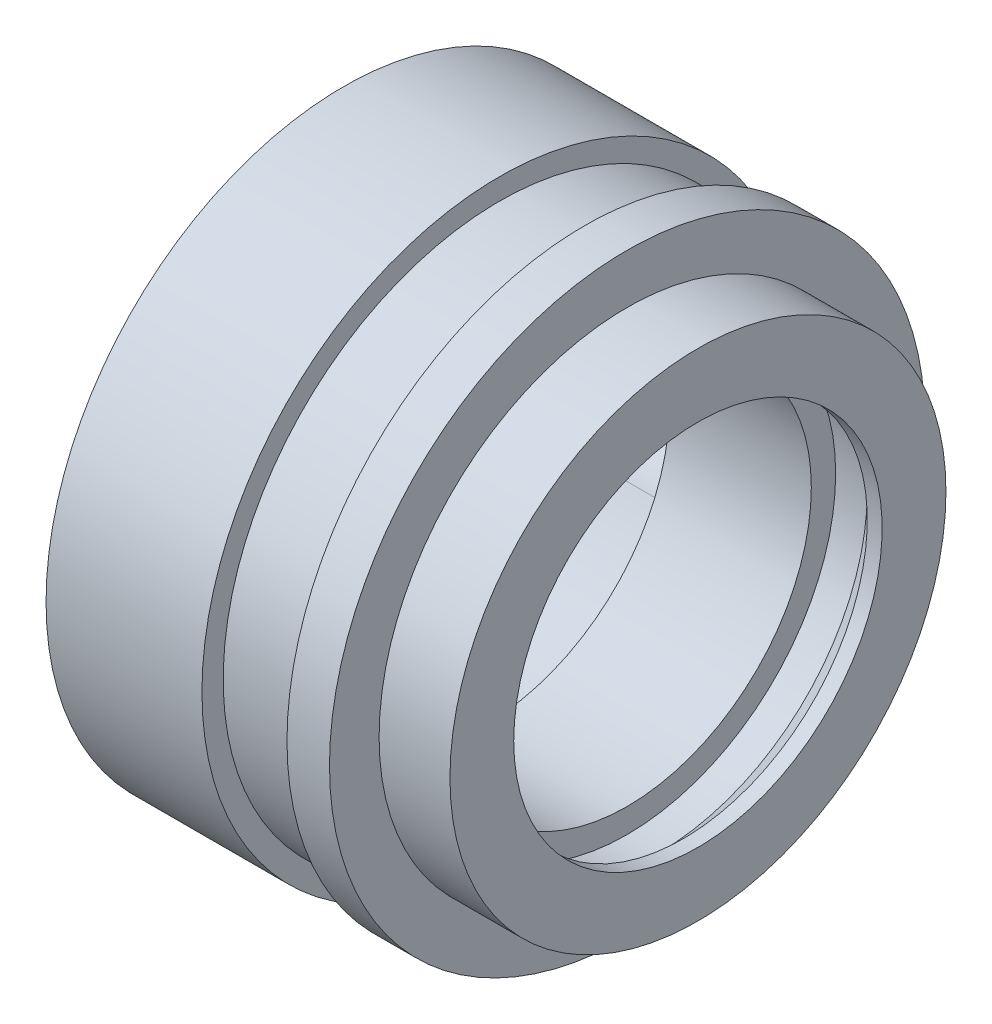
ISO-10303-21;
HEADER;
FILE_DESCRIPTION(('STEP AP214'),'2;1');
FILE_NAME('part.step','',(''),(''),'','','');
FILE_SCHEMA(('AUTOMOTIVE_DESIGN { 1 0 10303 214 1 1 1 1 }'));
ENDSEC;
DATA;
#1=APPLICATION_CONTEXT('core data for automotive mechanical design processes');
#2=APPLICATION_PROTOCOL_DEFINITION('international standard','automotive_design',2000,#1);
#3=PRODUCT_CONTEXT('',#1,'mechanical');
#4=PRODUCT('Part','Part','',(#3));
#5=PRODUCT_RELATED_PRODUCT_CATEGORY('part','',(#4));
#6=PRODUCT_DEFINITION_FORMATION('','',#4);
#7=PRODUCT_DEFINITION_CONTEXT('part definition',#1,'design');
#8=PRODUCT_DEFINITION('design','',#6,#7);
#9=PRODUCT_DEFINITION_SHAPE('','',#8);
#10=(LENGTH_UNIT() NAMED_UNIT(*) SI_UNIT(.MILLI.,.METRE.));
#11=(NAMED_UNIT(*) PLANE_ANGLE_UNIT() SI_UNIT($,.RADIAN.));
#12=(NAMED_UNIT(*) SI_UNIT($,.STERADIAN.) SOLID_ANGLE_UNIT());
#13=UNCERTAINTY_MEASURE_WITH_UNIT(LENGTH_MEASURE(1.E-05),#10,'distance_accuracy_value','');
#14=(GEOMETRIC_REPRESENTATION_CONTEXT(3) GLOBAL_UNCERTAINTY_ASSIGNED_CONTEXT((#13)) GLOBAL_UNIT_ASSIGNED_CONTEXT((#10,
#11,#12)) REPRESENTATION_CONTEXT('',''));
#15=CARTESIAN_POINT('',(0.,0.,0.));
#16=DIRECTION('',(0.,0.,1.));
#17=DIRECTION('',(1.,0.,0.));
#18=AXIS2_PLACEMENT_3D('',#15,#16,#17);
#19=CARTESIAN_POINT('',(-13.5,21.,0.));
#20=DIRECTION('',(-1.,0.,0.));
#21=DIRECTION('',(0.,0.,1.));
#22=AXIS2_PLACEMENT_3D('',#19,#20,#21);
#23=PLANE('',#22);
#24=CARTESIAN_POINT('',(-13.5,0.,0.));
#25=DIRECTION('',(1.,0.,0.));
#26=DIRECTION('',(0.,0.,-1.));
#27=AXIS2_PLACEMENT_3D('',#24,#25,#26);
#28=CIRCLE('',#27,21.);
#29=CARTESIAN_POINT('',(-13.5,0.,-21.));
#30=VERTEX_POINT('',#29);
#31=EDGE_CURVE('E164',#30,#30,#28,.T.);
#32=ORIENTED_EDGE('',*,*,#31,.F.);
#33=EDGE_LOOP('',(#32));
#34=FACE_BOUND('',#33,.T.);
#35=CARTESIAN_POINT('',(-13.5,0.,14.5));
#36=DIRECTION('',(1.,0.,0.));
#37=DIRECTION('',(0.,0.,-1.));
#38=AXIS2_PLACEMENT_3D('',#35,#36,#37);
#39=CIRCLE('',#38,4.75);
#40=CARTESIAN_POINT('',(-13.5,4.54245800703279,15.8887315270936));
#41=VERTEX_POINT('',#40);
#42=CARTESIAN_POINT('',(-13.5,-4.54245800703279,15.8887315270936));
#43=VERTEX_POINT('',#42);
#44=EDGE_CURVE('E101',#41,#43,#39,.T.);
#45=ORIENTED_EDGE('',*,*,#44,.T.);
#46=CARTESIAN_POINT('',(-13.5,-8.36768580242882,17.0581896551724));
#47=DIRECTION('',(-1.,0.,0.));
#48=DIRECTION('',(0.,0.,1.));
#49=AXIS2_PLACEMENT_3D('',#46,#47,#48);
#50=CIRCLE('',#49,4.);
#51=CARTESIAN_POINT('',(-13.5,-6.60606773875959,13.4669918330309));
#52=VERTEX_POINT('',#51);
#53=EDGE_CURVE('E108',#43,#52,#50,.T.);
#54=ORIENTED_EDGE('',*,*,#53,.T.);
#55=CARTESIAN_POINT('',(-13.5,0.,0.));
#56=DIRECTION('',(-1.,0.,0.));
#57=DIRECTION('',(0.,0.,1.));
#58=AXIS2_PLACEMENT_3D('',#55,#56,#57);
#59=CIRCLE('',#58,15.);
#60=CARTESIAN_POINT('',(-13.5,-6.60606773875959,-13.4669918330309));
#61=VERTEX_POINT('',#60);
#62=EDGE_CURVE('E204',#61,#52,#59,.T.);
#63=ORIENTED_EDGE('',*,*,#62,.F.);
#64=CARTESIAN_POINT('',(-13.5,-8.36768580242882,-17.0581896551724));
#65=DIRECTION('',(-1.,0.,0.));
#66=DIRECTION('',(0.,0.,1.));
#67=AXIS2_PLACEMENT_3D('',#64,#65,#66);
#68=CIRCLE('',#67,4.);
#69=CARTESIAN_POINT('',(-13.5,-4.54245800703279,-15.8887315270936));
#70=VERTEX_POINT('',#69);
#71=EDGE_CURVE('E126',#61,#70,#68,.T.);
#72=ORIENTED_EDGE('',*,*,#71,.T.);
#73=CARTESIAN_POINT('',(-13.5,0.,-14.5));
#74=DIRECTION('',(-1.,0.,0.));
#75=DIRECTION('',(0.,0.,1.));
#76=AXIS2_PLACEMENT_3D('',#73,#74,#75);
#77=CIRCLE('',#76,4.75);
#78=CARTESIAN_POINT('',(-13.5,4.54245800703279,-15.8887315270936));
#79=VERTEX_POINT('',#78);
#80=EDGE_CURVE('E277',#79,#70,#77,.T.);
#81=ORIENTED_EDGE('',*,*,#80,.F.);
#82=CARTESIAN_POINT('',(-13.5,8.36768580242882,-17.0581896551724));
#83=DIRECTION('',(-1.,0.,0.));
#84=DIRECTION('',(0.,0.,1.));
#85=AXIS2_PLACEMENT_3D('',#82,#83,#84);
#86=CIRCLE('',#85,4.);
#87=CARTESIAN_POINT('',(-13.5,6.60606773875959,-13.4669918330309));
#88=VERTEX_POINT('',#87);
#89=EDGE_CURVE('E109',#79,#88,#86,.T.);
#90=ORIENTED_EDGE('',*,*,#89,.T.);
#91=CARTESIAN_POINT('',(-13.5,6.60606773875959,13.4669918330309));
#92=VERTEX_POINT('',#91);
#93=EDGE_CURVE('E103',#92,#88,#59,.T.);
#94=ORIENTED_EDGE('',*,*,#93,.F.);
#95=CARTESIAN_POINT('',(-13.5,8.36768580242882,17.0581896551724));
#96=DIRECTION('',(-1.,0.,0.));
#97=DIRECTION('',(0.,0.,1.));
#98=AXIS2_PLACEMENT_3D('',#95,#96,#97);
#99=CIRCLE('',#98,4.);
#100=EDGE_CURVE('E99',#92,#41,#99,.T.);
#101=ORIENTED_EDGE('',*,*,#100,.T.);
#102=EDGE_LOOP('',(#45,#54,#63,#72,#81,#90,#94,#101));
#103=FACE_BOUND('',#102,.T.);
#104=ADVANCED_FACE('F34',(#34,#103),#23,.T.);
#105=CARTESIAN_POINT('',(0.,0.,0.));
#106=DIRECTION('',(-1.,0.,0.));
#107=DIRECTION('',(0.,0.,1.));
#108=AXIS2_PLACEMENT_3D('',#105,#106,#107);
#109=CYLINDRICAL_SURFACE('',#108,15.);
#110=CARTESIAN_POINT('',(-3.5,0.,0.));
#111=DIRECTION('',(-1.,0.,0.));
#112=DIRECTION('',(0.,0.,1.));
#113=AXIS2_PLACEMENT_3D('',#110,#111,#112);
#114=CIRCLE('',#113,15.);
#115=CARTESIAN_POINT('',(-3.5,6.60606773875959,13.4669918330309));
#116=VERTEX_POINT('',#115);
#117=CARTESIAN_POINT('',(-3.5,6.60606773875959,-13.4669918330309));
#118=VERTEX_POINT('',#117);
#119=EDGE_CURVE('E156',#116,#118,#114,.T.);
#120=ORIENTED_EDGE('',*,*,#119,.F.);
#121=DIRECTION('',(-1.,0.,0.));
#122=VECTOR('',#121,1.);
#123=CARTESIAN_POINT('',(0.,6.60606773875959,13.4669918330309));
#124=LINE('',#123,#122);
#125=EDGE_CURVE('E145',#116,#92,#124,.T.);
#126=ORIENTED_EDGE('',*,*,#125,.T.);
#127=ORIENTED_EDGE('',*,*,#93,.T.);
#128=DIRECTION('',(-1.,0.,0.));
#129=VECTOR('',#128,1.);
#130=CARTESIAN_POINT('',(0.,6.6060677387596,-13.4669918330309));
#131=LINE('',#130,#129);
#132=EDGE_CURVE('E143',#88,#118,#131,.F.);
#133=ORIENTED_EDGE('',*,*,#132,.T.);
#134=EDGE_LOOP('',(#120,#126,#127,#133));
#135=FACE_BOUND('',#134,.T.);
#136=ADVANCED_FACE('F158',(#135),#109,.F.);
#137=ORIENTED_EDGE('',*,*,#62,.T.);
#138=DIRECTION('',(-1.,0.,0.));
#139=VECTOR('',#138,1.);
#140=CARTESIAN_POINT('',(0.,-6.6060677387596,13.4669918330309));
#141=LINE('',#140,#139);
#142=CARTESIAN_POINT('',(-3.5,-6.60606773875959,13.4669918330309));
#143=VERTEX_POINT('',#142);
#144=EDGE_CURVE('E141',#52,#143,#141,.F.);
#145=ORIENTED_EDGE('',*,*,#144,.T.);
#146=CARTESIAN_POINT('',(-3.5,-6.60606773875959,-13.4669918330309));
#147=VERTEX_POINT('',#146);
#148=EDGE_CURVE('E160',#147,#143,#114,.T.);
#149=ORIENTED_EDGE('',*,*,#148,.F.);
#150=DIRECTION('',(-1.,0.,0.));
#151=VECTOR('',#150,1.);
#152=CARTESIAN_POINT('',(0.,-6.60606773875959,-13.4669918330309));
#153=LINE('',#152,#151);
#154=EDGE_CURVE('E138',#147,#61,#153,.T.);
#155=ORIENTED_EDGE('',*,*,#154,.T.);
#156=EDGE_LOOP('',(#137,#145,#149,#155));
#157=FACE_BOUND('',#156,.T.);
#158=ADVANCED_FACE('F222',(#157),#109,.F.);
#159=CARTESIAN_POINT('',(0.,0.,0.));
#160=DIRECTION('',(-1.,0.,0.));
#161=DIRECTION('',(0.,0.,1.));
#162=AXIS2_PLACEMENT_3D('',#159,#160,#161);
#163=CYLINDRICAL_SURFACE('',#162,13.);
#164=CARTESIAN_POINT('',(-3.5,0.,0.));
#165=DIRECTION('',(-1.,0.,0.));
#166=DIRECTION('',(0.,0.,1.));
#167=AXIS2_PLACEMENT_3D('',#164,#165,#166);
#168=CIRCLE('',#167,13.);
#169=CARTESIAN_POINT('',(-3.5,0.,13.));
#170=VERTEX_POINT('',#169);
#171=EDGE_CURVE('E161',#170,#170,#168,.T.);
#172=ORIENTED_EDGE('',*,*,#171,.T.);
#173=EDGE_LOOP('',(#172));
#174=FACE_BOUND('',#173,.T.);
#175=CARTESIAN_POINT('',(6.49999999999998,0.,0.));
#176=DIRECTION('',(1.,0.,0.));
#177=DIRECTION('',(0.,0.,-1.));
#178=AXIS2_PLACEMENT_3D('',#175,#176,#177);
#179=CIRCLE('',#178,13.);
#180=CARTESIAN_POINT('',(6.49999999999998,0.,-13.));
#181=VERTEX_POINT('',#180);
#182=EDGE_CURVE('E132',#181,#181,#179,.T.);
#183=ORIENTED_EDGE('',*,*,#182,.T.);
#184=EDGE_LOOP('',(#183));
#185=FACE_BOUND('',#184,.T.);
#186=ADVANCED_FACE('F213',(#174,#185),#163,.F.);
#187=CARTESIAN_POINT('',(11.5,0.,0.));
#188=DIRECTION('',(-1.,0.,0.));
#189=DIRECTION('',(0.,0.,1.));
#190=AXIS2_PLACEMENT_3D('',#187,#188,#189);
#191=CIRCLE('',#190,13.);
#192=CARTESIAN_POINT('',(11.5,0.,13.));
#193=VERTEX_POINT('',#192);
#194=EDGE_CURVE('E166',#193,#193,#191,.T.);
#195=ORIENTED_EDGE('',*,*,#194,.F.);
#196=EDGE_LOOP('',(#195));
#197=FACE_BOUND('',#196,.T.);
#198=CARTESIAN_POINT('',(10.4505,0.,0.));
#199=DIRECTION('',(-1.,0.,0.));
#200=DIRECTION('',(0.,0.,1.));
#201=AXIS2_PLACEMENT_3D('',#198,#199,#200);
#202=CIRCLE('',#201,13.);
#203=CARTESIAN_POINT('',(10.4505,0.,13.));
#204=VERTEX_POINT('',#203);
#205=EDGE_CURVE('E188',#204,#204,#202,.T.);
#206=ORIENTED_EDGE('',*,*,#205,.T.);
#207=EDGE_LOOP('',(#206));
#208=FACE_BOUND('',#207,.T.);
#209=ADVANCED_FACE('F211',(#197,#208),#163,.F.);
#210=CARTESIAN_POINT('',(11.5,0.,0.));
#211=DIRECTION('',(1.,0.,0.));
#212=DIRECTION('',(0.,0.,-1.));
#213=AXIS2_PLACEMENT_3D('',#210,#211,#212);
#214=PLANE('',#213);
#215=CARTESIAN_POINT('',(11.5,0.,0.));
#216=DIRECTION('',(1.,0.,0.));
#217=DIRECTION('',(0.,0.,-1.));
#218=AXIS2_PLACEMENT_3D('',#215,#216,#217);
#219=CIRCLE('',#218,17.5);
#220=CARTESIAN_POINT('',(11.5,0.,-17.5));
#221=VERTEX_POINT('',#220);
#222=EDGE_CURVE('E124',#221,#221,#219,.T.);
#223=ORIENTED_EDGE('',*,*,#222,.T.);
#224=EDGE_LOOP('',(#223));
#225=FACE_BOUND('',#224,.T.);
#226=ORIENTED_EDGE('',*,*,#194,.T.);
#227=EDGE_LOOP('',(#226));
#228=FACE_BOUND('',#227,.T.);
#229=ADVANCED_FACE('F209',(#225,#228),#214,.T.);
#230=CARTESIAN_POINT('',(35.4425685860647,0.,0.));
#231=DIRECTION('',(1.,0.,0.));
#232=DIRECTION('',(0.,0.,-1.));
#233=AXIS2_PLACEMENT_3D('',#230,#231,#232);
#234=CYLINDRICAL_SURFACE('',#233,17.5);
#235=CARTESIAN_POINT('',(6.5,0.,0.));
#236=DIRECTION('',(1.,0.,0.));
#237=DIRECTION('',(0.,0.,-1.));
#238=AXIS2_PLACEMENT_3D('',#235,#236,#237);
#239=CIRCLE('',#238,17.5);
#240=CARTESIAN_POINT('',(6.5,0.,-17.5));
#241=VERTEX_POINT('',#240);
#242=EDGE_CURVE('E129',#241,#241,#239,.T.);
#243=ORIENTED_EDGE('',*,*,#242,.T.);
#244=EDGE_LOOP('',(#243));
#245=FACE_BOUND('',#244,.T.);
#246=ORIENTED_EDGE('',*,*,#222,.F.);
#247=EDGE_LOOP('',(#246));
#248=FACE_BOUND('',#247,.T.);
#249=ADVANCED_FACE('F219',(#245,#248),#234,.T.);
#250=CARTESIAN_POINT('',(6.5,21.,0.));
#251=DIRECTION('',(1.,0.,0.));
#252=DIRECTION('',(0.,0.,-1.));
#253=AXIS2_PLACEMENT_3D('',#250,#251,#252);
#254=PLANE('',#253);
#255=CARTESIAN_POINT('',(6.5,0.,0.));
#256=DIRECTION('',(1.,0.,0.));
#257=DIRECTION('',(0.,0.,-1.));
#258=AXIS2_PLACEMENT_3D('',#255,#256,#257);
#259=CIRCLE('',#258,21.);
#260=CARTESIAN_POINT('',(6.5,0.,-21.));
#261=VERTEX_POINT('',#260);
#262=EDGE_CURVE('E184',#261,#261,#259,.T.);
#263=ORIENTED_EDGE('',*,*,#262,.T.);
#264=EDGE_LOOP('',(#263));
#265=FACE_BOUND('',#264,.T.);
#266=ORIENTED_EDGE('',*,*,#242,.F.);
#267=EDGE_LOOP('',(#266));
#268=FACE_BOUND('',#267,.T.);
#269=ADVANCED_FACE('F254',(#265,#268),#254,.T.);
#270=CARTESIAN_POINT('',(35.4425685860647,0.,0.));
#271=DIRECTION('',(1.,0.,0.));
#272=DIRECTION('',(0.,0.,-1.));
#273=AXIS2_PLACEMENT_3D('',#270,#271,#272);
#274=CYLINDRICAL_SURFACE('',#273,21.);
#275=CARTESIAN_POINT('',(3.5,0.,0.));
#276=DIRECTION('',(1.,0.,0.));
#277=DIRECTION('',(0.,0.,-1.));
#278=AXIS2_PLACEMENT_3D('',#275,#276,#277);
#279=CIRCLE('',#278,21.);
#280=CARTESIAN_POINT('',(3.5,0.,-21.));
#281=VERTEX_POINT('',#280);
#282=EDGE_CURVE('E181',#281,#281,#279,.T.);
#283=ORIENTED_EDGE('',*,*,#282,.T.);
#284=EDGE_LOOP('',(#283));
#285=FACE_BOUND('',#284,.T.);
#286=ORIENTED_EDGE('',*,*,#262,.F.);
#287=EDGE_LOOP('',(#286));
#288=FACE_BOUND('',#287,.T.);
#289=ADVANCED_FACE('F250',(#285,#288),#274,.T.);
#290=CARTESIAN_POINT('',(3.5,21.,0.));
#291=DIRECTION('',(-1.,0.,0.));
#292=DIRECTION('',(0.,0.,1.));
#293=AXIS2_PLACEMENT_3D('',#290,#291,#292);
#294=PLANE('',#293);
#295=CARTESIAN_POINT('',(3.5,0.,0.));
#296=DIRECTION('',(1.,0.,0.));
#297=DIRECTION('',(0.,0.,-1.));
#298=AXIS2_PLACEMENT_3D('',#295,#296,#297);
#299=CIRCLE('',#298,19.5);
#300=CARTESIAN_POINT('',(3.5,0.,-19.5));
#301=VERTEX_POINT('',#300);
#302=EDGE_CURVE('E178',#301,#301,#299,.T.);
#303=ORIENTED_EDGE('',*,*,#302,.T.);
#304=EDGE_LOOP('',(#303));
#305=FACE_BOUND('',#304,.T.);
#306=ORIENTED_EDGE('',*,*,#282,.F.);
#307=EDGE_LOOP('',(#306));
#308=FACE_BOUND('',#307,.T.);
#309=ADVANCED_FACE('F246',(#305,#308),#294,.T.);
#310=CARTESIAN_POINT('',(35.4425685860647,0.,0.));
#311=DIRECTION('',(1.,0.,0.));
#312=DIRECTION('',(0.,0.,-1.));
#313=AXIS2_PLACEMENT_3D('',#310,#311,#312);
#314=CYLINDRICAL_SURFACE('',#313,19.5);
#315=CARTESIAN_POINT('',(-2.5,0.,0.));
#316=DIRECTION('',(1.,0.,0.));
#317=DIRECTION('',(0.,0.,-1.));
#318=AXIS2_PLACEMENT_3D('',#315,#316,#317);
#319=CIRCLE('',#318,19.5);
#320=CARTESIAN_POINT('',(-2.5,0.,-19.5));
#321=VERTEX_POINT('',#320);
#322=EDGE_CURVE('E175',#321,#321,#319,.T.);
#323=ORIENTED_EDGE('',*,*,#322,.T.);
#324=EDGE_LOOP('',(#323));
#325=FACE_BOUND('',#324,.T.);
#326=ORIENTED_EDGE('',*,*,#302,.F.);
#327=EDGE_LOOP('',(#326));
#328=FACE_BOUND('',#327,.T.);
#329=ADVANCED_FACE('F242',(#325,#328),#314,.T.);
#330=CARTESIAN_POINT('',(-2.5,19.5,0.));
#331=DIRECTION('',(1.,0.,0.));
#332=DIRECTION('',(0.,0.,-1.));
#333=AXIS2_PLACEMENT_3D('',#330,#331,#332);
#334=PLANE('',#333);
#335=CARTESIAN_POINT('',(-2.5,0.,0.));
#336=DIRECTION('',(1.,0.,0.));
#337=DIRECTION('',(0.,0.,-1.));
#338=AXIS2_PLACEMENT_3D('',#335,#336,#337);
#339=CIRCLE('',#338,21.);
#340=CARTESIAN_POINT('',(-2.5,0.,-21.));
#341=VERTEX_POINT('',#340);
#342=EDGE_CURVE('E172',#341,#341,#339,.T.);
#343=ORIENTED_EDGE('',*,*,#342,.T.);
#344=EDGE_LOOP('',(#343));
#345=FACE_BOUND('',#344,.T.);
#346=ORIENTED_EDGE('',*,*,#322,.F.);
#347=EDGE_LOOP('',(#346));
#348=FACE_BOUND('',#347,.T.);
#349=ADVANCED_FACE('F238',(#345,#348),#334,.T.);
#350=CARTESIAN_POINT('',(35.4425685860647,0.,0.));
#351=DIRECTION('',(1.,0.,0.));
#352=DIRECTION('',(0.,0.,-1.));
#353=AXIS2_PLACEMENT_3D('',#350,#351,#352);
#354=CYLINDRICAL_SURFACE('',#353,21.);
#355=ORIENTED_EDGE('',*,*,#31,.T.);
#356=EDGE_LOOP('',(#355));
#357=FACE_BOUND('',#356,.T.);
#358=ORIENTED_EDGE('',*,*,#342,.F.);
#359=EDGE_LOOP('',(#358));
#360=FACE_BOUND('',#359,.T.);
#361=ADVANCED_FACE('F235',(#357,#360),#354,.T.);
#362=CARTESIAN_POINT('',(-3.5,15.,0.));
#363=DIRECTION('',(-1.,0.,0.));
#364=DIRECTION('',(0.,0.,1.));
#365=AXIS2_PLACEMENT_3D('',#362,#363,#364);
#366=PLANE('',#365);
#367=CARTESIAN_POINT('',(-3.5,0.,-14.5));
#368=DIRECTION('',(-1.,0.,0.));
#369=DIRECTION('',(0.,0.,1.));
#370=AXIS2_PLACEMENT_3D('',#367,#368,#369);
#371=CIRCLE('',#370,4.75);
#372=CARTESIAN_POINT('',(-3.5,-4.54245800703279,-15.8887315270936));
#373=VERTEX_POINT('',#372);
#374=CARTESIAN_POINT('',(-3.5,4.54245800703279,-15.8887315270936));
#375=VERTEX_POINT('',#374);
#376=EDGE_CURVE('E200',#373,#375,#371,.F.);
#377=ORIENTED_EDGE('',*,*,#376,.F.);
#378=CARTESIAN_POINT('',(-3.5,-8.36768580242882,-17.0581896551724));
#379=DIRECTION('',(-1.,0.,0.));
#380=DIRECTION('',(0.,0.,1.));
#381=AXIS2_PLACEMENT_3D('',#378,#379,#380);
#382=CIRCLE('',#381,4.);
#383=EDGE_CURVE('E11',#373,#147,#382,.F.);
#384=ORIENTED_EDGE('',*,*,#383,.T.);
#385=ORIENTED_EDGE('',*,*,#148,.T.);
#386=CARTESIAN_POINT('',(-3.5,-8.36768580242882,17.0581896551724));
#387=DIRECTION('',(-1.,0.,0.));
#388=DIRECTION('',(0.,0.,1.));
#389=AXIS2_PLACEMENT_3D('',#386,#387,#388);
#390=CIRCLE('',#389,4.);
#391=CARTESIAN_POINT('',(-3.5,-4.54245800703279,15.8887315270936));
#392=VERTEX_POINT('',#391);
#393=EDGE_CURVE('E151',#143,#392,#390,.F.);
#394=ORIENTED_EDGE('',*,*,#393,.T.);
#395=CARTESIAN_POINT('',(-3.5,0.,14.5));
#396=DIRECTION('',(-1.,0.,0.));
#397=DIRECTION('',(0.,0.,1.));
#398=AXIS2_PLACEMENT_3D('',#395,#396,#397);
#399=CIRCLE('',#398,4.75);
#400=CARTESIAN_POINT('',(-3.5,4.54245800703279,15.8887315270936));
#401=VERTEX_POINT('',#400);
#402=EDGE_CURVE('E119',#392,#401,#399,.T.);
#403=ORIENTED_EDGE('',*,*,#402,.T.);
#404=CARTESIAN_POINT('',(-3.5,8.36768580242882,17.0581896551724));
#405=DIRECTION('',(-1.,0.,0.));
#406=DIRECTION('',(0.,0.,1.));
#407=AXIS2_PLACEMENT_3D('',#404,#405,#406);
#408=CIRCLE('',#407,4.);
#409=EDGE_CURVE('E123',#401,#116,#408,.F.);
#410=ORIENTED_EDGE('',*,*,#409,.T.);
#411=ORIENTED_EDGE('',*,*,#119,.T.);
#412=CARTESIAN_POINT('',(-3.5,8.36768580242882,-17.0581896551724));
#413=DIRECTION('',(-1.,0.,0.));
#414=DIRECTION('',(0.,0.,1.));
#415=AXIS2_PLACEMENT_3D('',#412,#413,#414);
#416=CIRCLE('',#415,4.);
#417=EDGE_CURVE('E42',#118,#375,#416,.F.);
#418=ORIENTED_EDGE('',*,*,#417,.T.);
#419=EDGE_LOOP('',(#377,#384,#385,#394,#403,#410,#411,#418));
#420=FACE_BOUND('',#419,.T.);
#421=ORIENTED_EDGE('',*,*,#171,.F.);
#422=EDGE_LOOP('',(#421));
#423=FACE_BOUND('',#422,.T.);
#424=ADVANCED_FACE('F154',(#420,#423),#366,.T.);
#425=CARTESIAN_POINT('',(6.49999999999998,7.105,0.));
#426=DIRECTION('',(1.,0.,0.));
#427=DIRECTION('',(0.,0.,-1.));
#428=AXIS2_PLACEMENT_3D('',#425,#426,#427);
#429=PLANE('',#428);
#430=ORIENTED_EDGE('',*,*,#182,.F.);
#431=EDGE_LOOP('',(#430));
#432=FACE_BOUND('',#431,.T.);
#433=CARTESIAN_POINT('',(6.49999999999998,0.,0.));
#434=DIRECTION('',(-1.,0.,0.));
#435=DIRECTION('',(0.,0.,1.));
#436=AXIS2_PLACEMENT_3D('',#433,#434,#435);
#437=CIRCLE('',#436,14.7175);
#438=CARTESIAN_POINT('',(6.49999999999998,0.,14.7175));
#439=VERTEX_POINT('',#438);
#440=EDGE_CURVE('E190',#439,#439,#437,.T.);
#441=ORIENTED_EDGE('',*,*,#440,.F.);
#442=EDGE_LOOP('',(#441));
#443=FACE_BOUND('',#442,.T.);
#444=ADVANCED_FACE('F313',(#432,#443),#429,.T.);
#445=CARTESIAN_POINT('',(-59.2098157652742,0.,0.));
#446=DIRECTION('',(-1.,0.,0.));
#447=DIRECTION('',(0.,0.,1.));
#448=AXIS2_PLACEMENT_3D('',#445,#446,#447);
#449=CYLINDRICAL_SURFACE('',#448,14.7175);
#450=ORIENTED_EDGE('',*,*,#440,.T.);
#451=EDGE_LOOP('',(#450));
#452=FACE_BOUND('',#451,.T.);
#453=CARTESIAN_POINT('',(8.73299999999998,0.,0.));
#454=DIRECTION('',(-1.,0.,0.));
#455=DIRECTION('',(0.,0.,1.));
#456=AXIS2_PLACEMENT_3D('',#453,#454,#455);
#457=CIRCLE('',#456,14.7175);
#458=CARTESIAN_POINT('',(8.73299999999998,0.,14.7175));
#459=VERTEX_POINT('',#458);
#460=EDGE_CURVE('E195',#459,#459,#457,.T.);
#461=ORIENTED_EDGE('',*,*,#460,.F.);
#462=EDGE_LOOP('',(#461));
#463=FACE_BOUND('',#462,.T.);
#464=ADVANCED_FACE('F397',(#452,#463),#449,.F.);
#465=CARTESIAN_POINT('',(13.605,0.,0.));
#466=DIRECTION('',(-1.,0.,0.));
#467=DIRECTION('',(0.,0.,1.));
#468=AXIS2_PLACEMENT_3D('',#465,#466,#467);
#469=CONICAL_SURFACE('',#468,9.84549999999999,0.78539816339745);
#470=ORIENTED_EDGE('',*,*,#205,.F.);
#471=EDGE_LOOP('',(#470));
#472=FACE_BOUND('',#471,.T.);
#473=ORIENTED_EDGE('',*,*,#460,.T.);
#474=EDGE_LOOP('',(#473));
#475=FACE_BOUND('',#474,.T.);
#476=ADVANCED_FACE('F333',(#472,#475),#469,.F.);
#477=CARTESIAN_POINT('',(7.24450286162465,0.,-14.5));
#478=DIRECTION('',(-1.,0.,0.));
#479=DIRECTION('',(0.,0.,1.));
#480=AXIS2_PLACEMENT_3D('',#477,#478,#479);
#481=CYLINDRICAL_SURFACE('',#480,4.75);
#482=ORIENTED_EDGE('',*,*,#376,.T.);
#483=DIRECTION('',(-1.,0.,0.));
#484=VECTOR('',#483,1.);
#485=CARTESIAN_POINT('',(7.24450286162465,4.54245800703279,-15.8887315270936));
#486=LINE('',#485,#484);
#487=EDGE_CURVE('E148',#375,#79,#486,.T.);
#488=ORIENTED_EDGE('',*,*,#487,.T.);
#489=ORIENTED_EDGE('',*,*,#80,.T.);
#490=DIRECTION('',(-1.,0.,0.));
#491=VECTOR('',#490,1.);
#492=CARTESIAN_POINT('',(7.24450286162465,-4.54245800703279,-15.8887315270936));
#493=LINE('',#492,#491);
#494=EDGE_CURVE('E55',#70,#373,#493,.F.);
#495=ORIENTED_EDGE('',*,*,#494,.T.);
#496=EDGE_LOOP('',(#482,#488,#489,#495));
#497=FACE_BOUND('',#496,.T.);
#498=ADVANCED_FACE('F276',(#497),#481,.F.);
#499=CARTESIAN_POINT('',(7.24450286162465,0.,14.5));
#500=DIRECTION('',(-1.,0.,0.));
#501=DIRECTION('',(0.,0.,1.));
#502=AXIS2_PLACEMENT_3D('',#499,#500,#501);
#503=CYLINDRICAL_SURFACE('',#502,4.75);
#504=ORIENTED_EDGE('',*,*,#402,.F.);
#505=DIRECTION('',(-1.,0.,0.));
#506=VECTOR('',#505,1.);
#507=CARTESIAN_POINT('',(7.24450286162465,-4.54245800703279,15.8887315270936));
#508=LINE('',#507,#506);
#509=EDGE_CURVE('E118',#392,#43,#508,.T.);
#510=ORIENTED_EDGE('',*,*,#509,.T.);
#511=ORIENTED_EDGE('',*,*,#44,.F.);
#512=DIRECTION('',(-1.,0.,0.));
#513=VECTOR('',#512,1.);
#514=CARTESIAN_POINT('',(7.24450286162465,4.54245800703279,15.8887315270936));
#515=LINE('',#514,#513);
#516=EDGE_CURVE('E115',#41,#401,#515,.F.);
#517=ORIENTED_EDGE('',*,*,#516,.T.);
#518=EDGE_LOOP('',(#504,#510,#511,#517));
#519=FACE_BOUND('',#518,.T.);
#520=ADVANCED_FACE('F114',(#519),#503,.F.);
#521=CARTESIAN_POINT('',(0.,-8.36768580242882,17.0581896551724));
#522=DIRECTION('',(-1.,0.,0.));
#523=DIRECTION('',(0.,0.,1.));
#524=AXIS2_PLACEMENT_3D('',#521,#522,#523);
#525=CYLINDRICAL_SURFACE('',#524,4.);
#526=ORIENTED_EDGE('',*,*,#393,.F.);
#527=ORIENTED_EDGE('',*,*,#144,.F.);
#528=ORIENTED_EDGE('',*,*,#53,.F.);
#529=ORIENTED_EDGE('',*,*,#509,.F.);
#530=EDGE_LOOP('',(#526,#527,#528,#529));
#531=FACE_BOUND('',#530,.T.);
#532=ADVANCED_FACE('F262',(#531),#525,.T.);
#533=CARTESIAN_POINT('',(7.24450286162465,8.36768580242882,17.0581896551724));
#534=DIRECTION('',(-1.,0.,0.));
#535=DIRECTION('',(0.,0.,1.));
#536=AXIS2_PLACEMENT_3D('',#533,#534,#535);
#537=CYLINDRICAL_SURFACE('',#536,4.);
#538=ORIENTED_EDGE('',*,*,#409,.F.);
#539=ORIENTED_EDGE('',*,*,#516,.F.);
#540=ORIENTED_EDGE('',*,*,#100,.F.);
#541=ORIENTED_EDGE('',*,*,#125,.F.);
#542=EDGE_LOOP('',(#538,#539,#540,#541));
#543=FACE_BOUND('',#542,.T.);
#544=ADVANCED_FACE('F122',(#543),#537,.T.);
#545=CARTESIAN_POINT('',(0.,8.36768580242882,-17.0581896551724));
#546=DIRECTION('',(-1.,0.,0.));
#547=DIRECTION('',(0.,0.,1.));
#548=AXIS2_PLACEMENT_3D('',#545,#546,#547);
#549=CYLINDRICAL_SURFACE('',#548,4.);
#550=ORIENTED_EDGE('',*,*,#417,.F.);
#551=ORIENTED_EDGE('',*,*,#132,.F.);
#552=ORIENTED_EDGE('',*,*,#89,.F.);
#553=ORIENTED_EDGE('',*,*,#487,.F.);
#554=EDGE_LOOP('',(#550,#551,#552,#553));
#555=FACE_BOUND('',#554,.T.);
#556=ADVANCED_FACE('F267',(#555),#549,.T.);
#557=CARTESIAN_POINT('',(7.24450286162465,-8.36768580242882,-17.0581896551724));
#558=DIRECTION('',(-1.,0.,0.));
#559=DIRECTION('',(0.,0.,1.));
#560=AXIS2_PLACEMENT_3D('',#557,#558,#559);
#561=CYLINDRICAL_SURFACE('',#560,4.);
#562=ORIENTED_EDGE('',*,*,#383,.F.);
#563=ORIENTED_EDGE('',*,*,#494,.F.);
#564=ORIENTED_EDGE('',*,*,#71,.F.);
#565=ORIENTED_EDGE('',*,*,#154,.F.);
#566=EDGE_LOOP('',(#562,#563,#564,#565));
#567=FACE_BOUND('',#566,.T.);
#568=ADVANCED_FACE('F36',(#567),#561,.T.);
#569=CLOSED_SHELL('',(#104,#136,#158,#186,#209,#229,#249,#269,#289,#309,#329,#349,#361,#424,
#444,#464,#476,#498,#520,#532,#544,#556,#568));
#570=MANIFOLD_SOLID_BREP('B2',#569);
#571=ADVANCED_BREP_SHAPE_REPRESENTATION('',(#18,#570),#14);
#572=SHAPE_DEFINITION_REPRESENTATION(#9,#571);
ENDSEC;
END-ISO-10303-21;
